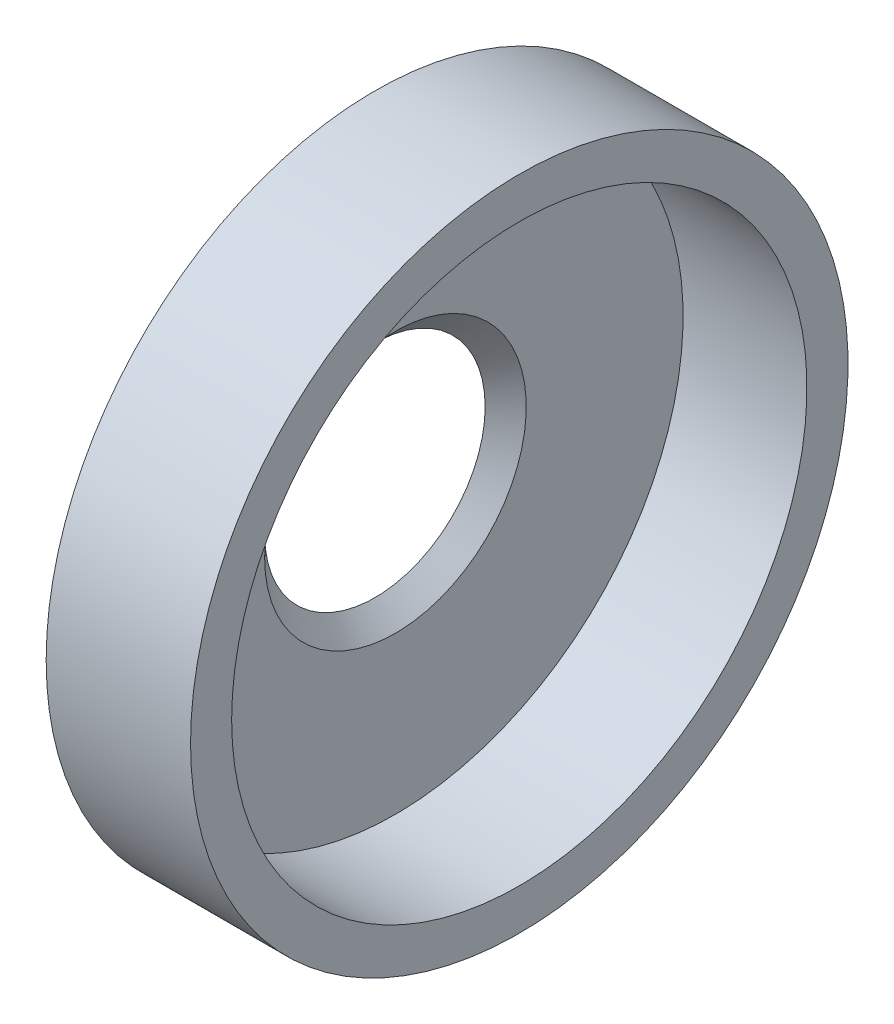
ISO-10303-21;
HEADER;
FILE_DESCRIPTION(('STEP AP214'),'2;1');
FILE_NAME('part.step','',(''),(''),'','','');
FILE_SCHEMA(('AUTOMOTIVE_DESIGN { 1 0 10303 214 1 1 1 1 }'));
ENDSEC;
DATA;
#1=APPLICATION_CONTEXT('core data for automotive mechanical design processes');
#2=APPLICATION_PROTOCOL_DEFINITION('international standard','automotive_design',2000,#1);
#3=PRODUCT_CONTEXT('',#1,'mechanical');
#4=PRODUCT('Part','Part','',(#3));
#5=PRODUCT_RELATED_PRODUCT_CATEGORY('part','',(#4));
#6=PRODUCT_DEFINITION_FORMATION('','',#4);
#7=PRODUCT_DEFINITION_CONTEXT('part definition',#1,'design');
#8=PRODUCT_DEFINITION('design','',#6,#7);
#9=PRODUCT_DEFINITION_SHAPE('','',#8);
#10=(LENGTH_UNIT() NAMED_UNIT(*) SI_UNIT(.MILLI.,.METRE.));
#11=(NAMED_UNIT(*) PLANE_ANGLE_UNIT() SI_UNIT($,.RADIAN.));
#12=(NAMED_UNIT(*) SI_UNIT($,.STERADIAN.) SOLID_ANGLE_UNIT());
#13=UNCERTAINTY_MEASURE_WITH_UNIT(LENGTH_MEASURE(1.E-05),#10,'distance_accuracy_value','');
#14=(GEOMETRIC_REPRESENTATION_CONTEXT(3) GLOBAL_UNCERTAINTY_ASSIGNED_CONTEXT((#13)) GLOBAL_UNIT_ASSIGNED_CONTEXT((#10,
#11,#12)) REPRESENTATION_CONTEXT('',''));
#15=CARTESIAN_POINT('',(0.,0.,0.));
#16=DIRECTION('',(0.,0.,1.));
#17=DIRECTION('',(1.,0.,0.));
#18=AXIS2_PLACEMENT_3D('',#15,#16,#17);
#19=CARTESIAN_POINT('',(0.,12.7,0.));
#20=DIRECTION('',(1.,0.,0.));
#21=DIRECTION('',(0.,0.,-1.));
#22=AXIS2_PLACEMENT_3D('',#19,#20,#21);
#23=PLANE('',#22);
#24=CARTESIAN_POINT('',(0.,0.,0.));
#25=DIRECTION('',(-1.,0.,0.));
#26=DIRECTION('',(0.,0.,1.));
#27=AXIS2_PLACEMENT_3D('',#24,#25,#26);
#28=CIRCLE('',#27,4.26);
#29=CARTESIAN_POINT('',(0.,0.,4.26));
#30=VERTEX_POINT('',#29);
#31=EDGE_CURVE('E52',#30,#30,#28,.T.);
#32=ORIENTED_EDGE('',*,*,#31,.F.);
#33=EDGE_LOOP('',(#32));
#34=FACE_BOUND('',#33,.T.);
#35=CARTESIAN_POINT('',(0.,0.,0.));
#36=DIRECTION('',(-1.,0.,0.));
#37=DIRECTION('',(0.,0.,1.));
#38=AXIS2_PLACEMENT_3D('',#35,#36,#37);
#39=CIRCLE('',#38,12.7);
#40=CARTESIAN_POINT('',(0.,0.,12.7));
#41=VERTEX_POINT('',#40);
#42=EDGE_CURVE('E10',#41,#41,#39,.T.);
#43=ORIENTED_EDGE('',*,*,#42,.T.);
#44=EDGE_LOOP('',(#43));
#45=FACE_BOUND('',#44,.T.);
#46=ADVANCED_FACE('F30',(#34,#45),#23,.F.);
#47=CARTESIAN_POINT('',(0.,0.,0.));
#48=DIRECTION('',(-1.,0.,0.));
#49=DIRECTION('',(0.,0.,1.));
#50=AXIS2_PLACEMENT_3D('',#47,#48,#49);
#51=CYLINDRICAL_SURFACE('',#50,12.7);
#52=ORIENTED_EDGE('',*,*,#42,.F.);
#53=EDGE_LOOP('',(#52));
#54=FACE_BOUND('',#53,.T.);
#55=CARTESIAN_POINT('',(5.5778,0.,0.));
#56=DIRECTION('',(-1.,0.,0.));
#57=DIRECTION('',(0.,0.,1.));
#58=AXIS2_PLACEMENT_3D('',#55,#56,#57);
#59=CIRCLE('',#58,12.7);
#60=CARTESIAN_POINT('',(5.5778,0.,12.7));
#61=VERTEX_POINT('',#60);
#62=EDGE_CURVE('E36',#61,#61,#59,.T.);
#63=ORIENTED_EDGE('',*,*,#62,.T.);
#64=EDGE_LOOP('',(#63));
#65=FACE_BOUND('',#64,.T.);
#66=ADVANCED_FACE('F59',(#54,#65),#51,.T.);
#67=CARTESIAN_POINT('',(5.5778,12.7,0.));
#68=DIRECTION('',(-1.,0.,0.));
#69=DIRECTION('',(0.,0.,1.));
#70=AXIS2_PLACEMENT_3D('',#67,#68,#69);
#71=PLANE('',#70);
#72=ORIENTED_EDGE('',*,*,#62,.F.);
#73=EDGE_LOOP('',(#72));
#74=FACE_BOUND('',#73,.T.);
#75=CARTESIAN_POINT('',(5.5778,0.,0.));
#76=DIRECTION('',(-1.,0.,0.));
#77=DIRECTION('',(0.,0.,1.));
#78=AXIS2_PLACEMENT_3D('',#75,#76,#77);
#79=CIRCLE('',#78,11.1125);
#80=CARTESIAN_POINT('',(5.5778,0.,11.1125));
#81=VERTEX_POINT('',#80);
#82=EDGE_CURVE('E40',#81,#81,#79,.T.);
#83=ORIENTED_EDGE('',*,*,#82,.T.);
#84=EDGE_LOOP('',(#83));
#85=FACE_BOUND('',#84,.T.);
#86=ADVANCED_FACE('F63',(#74,#85),#71,.F.);
#87=CARTESIAN_POINT('',(0.,0.,0.));
#88=DIRECTION('',(-1.,0.,0.));
#89=DIRECTION('',(0.,0.,1.));
#90=AXIS2_PLACEMENT_3D('',#87,#88,#89);
#91=CYLINDRICAL_SURFACE('',#90,11.1125);
#92=ORIENTED_EDGE('',*,*,#82,.F.);
#93=EDGE_LOOP('',(#92));
#94=FACE_BOUND('',#93,.T.);
#95=CARTESIAN_POINT('',(0.79375,0.,0.));
#96=DIRECTION('',(-1.,0.,0.));
#97=DIRECTION('',(0.,0.,1.));
#98=AXIS2_PLACEMENT_3D('',#95,#96,#97);
#99=CIRCLE('',#98,11.1125);
#100=CARTESIAN_POINT('',(0.79375,0.,11.1125));
#101=VERTEX_POINT('',#100);
#102=EDGE_CURVE('E44',#101,#101,#99,.T.);
#103=ORIENTED_EDGE('',*,*,#102,.T.);
#104=EDGE_LOOP('',(#103));
#105=FACE_BOUND('',#104,.T.);
#106=ADVANCED_FACE('F68',(#94,#105),#91,.F.);
#107=CARTESIAN_POINT('',(0.793750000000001,11.1125,0.));
#108=DIRECTION('',(-1.,0.,0.));
#109=DIRECTION('',(0.,0.,1.));
#110=AXIS2_PLACEMENT_3D('',#107,#108,#109);
#111=PLANE('',#110);
#112=ORIENTED_EDGE('',*,*,#102,.F.);
#113=EDGE_LOOP('',(#112));
#114=FACE_BOUND('',#113,.T.);
#115=CARTESIAN_POINT('',(0.793750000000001,0.,0.));
#116=DIRECTION('',(-1.,0.,0.));
#117=DIRECTION('',(0.,0.,1.));
#118=AXIS2_PLACEMENT_3D('',#115,#116,#117);
#119=CIRCLE('',#118,5.05375000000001);
#120=CARTESIAN_POINT('',(0.793750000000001,0.,5.05375000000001));
#121=VERTEX_POINT('',#120);
#122=EDGE_CURVE('E49',#121,#121,#119,.T.);
#123=ORIENTED_EDGE('',*,*,#122,.T.);
#124=EDGE_LOOP('',(#123));
#125=FACE_BOUND('',#124,.T.);
#126=ADVANCED_FACE('F74',(#114,#125),#111,.F.);
#127=CARTESIAN_POINT('',(0.,0.,0.));
#128=DIRECTION('',(1.,0.,0.));
#129=DIRECTION('',(0.,0.,-1.));
#130=AXIS2_PLACEMENT_3D('',#127,#128,#129);
#131=CONICAL_SURFACE('',#130,4.26,0.785398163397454);
#132=ORIENTED_EDGE('',*,*,#122,.F.);
#133=EDGE_LOOP('',(#132));
#134=FACE_BOUND('',#133,.T.);
#135=ORIENTED_EDGE('',*,*,#31,.T.);
#136=EDGE_LOOP('',(#135));
#137=FACE_BOUND('',#136,.T.);
#138=ADVANCED_FACE('F56',(#134,#137),#131,.F.);
#139=CLOSED_SHELL('',(#46,#66,#86,#106,#126,#138));
#140=MANIFOLD_SOLID_BREP('B2',#139);
#141=ADVANCED_BREP_SHAPE_REPRESENTATION('',(#18,#140),#14);
#142=SHAPE_DEFINITION_REPRESENTATION(#9,#141);
ENDSEC;
END-ISO-10303-21;
